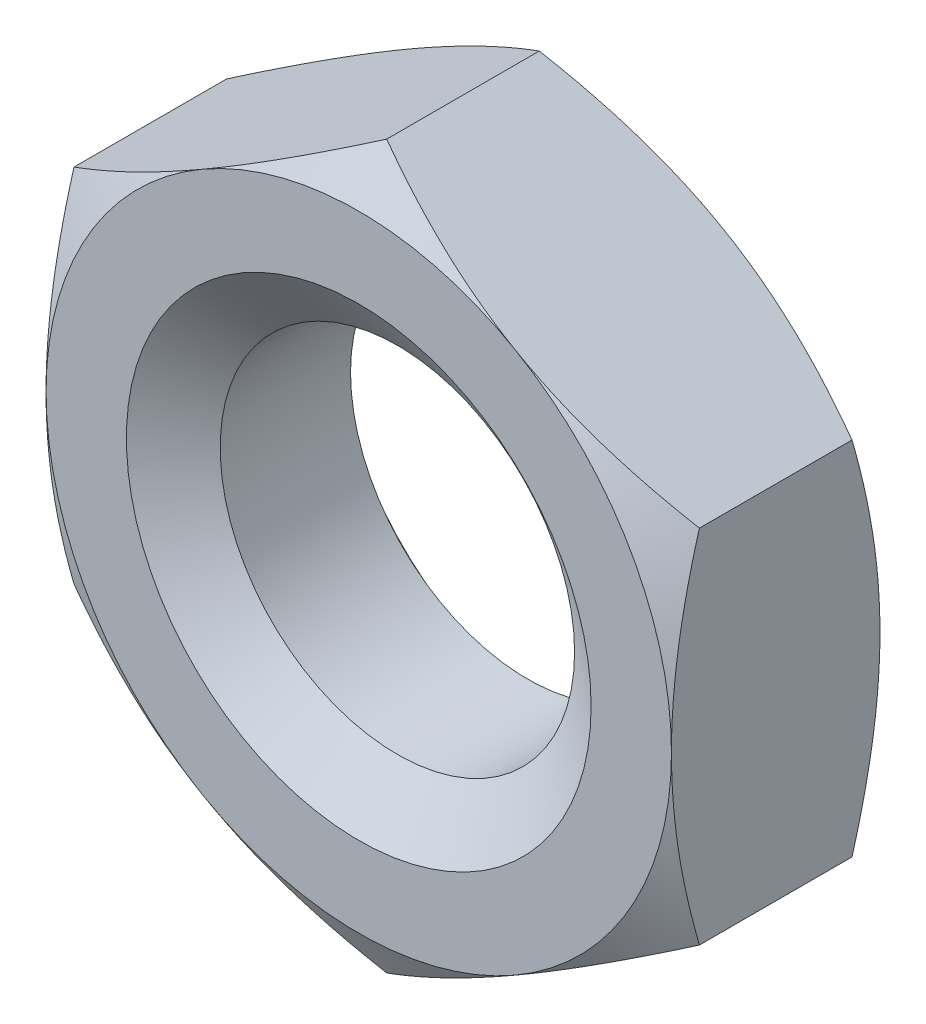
ISO-10303-21;
HEADER;
FILE_DESCRIPTION(('STEP AP214'),'2;1');
FILE_NAME('part.step','',(''),(''),'','','');
FILE_SCHEMA(('AUTOMOTIVE_DESIGN { 1 0 10303 214 1 1 1 1 }'));
ENDSEC;
DATA;
#1=APPLICATION_CONTEXT('core data for automotive mechanical design processes');
#2=APPLICATION_PROTOCOL_DEFINITION('international standard','automotive_design',2000,#1);
#3=PRODUCT_CONTEXT('',#1,'mechanical');
#4=PRODUCT('Part','Part','',(#3));
#5=PRODUCT_RELATED_PRODUCT_CATEGORY('part','',(#4));
#6=PRODUCT_DEFINITION_FORMATION('','',#4);
#7=PRODUCT_DEFINITION_CONTEXT('part definition',#1,'design');
#8=PRODUCT_DEFINITION('design','',#6,#7);
#9=PRODUCT_DEFINITION_SHAPE('','',#8);
#10=(LENGTH_UNIT() NAMED_UNIT(*) SI_UNIT(.MILLI.,.METRE.));
#11=(NAMED_UNIT(*) PLANE_ANGLE_UNIT() SI_UNIT($,.RADIAN.));
#12=(NAMED_UNIT(*) SI_UNIT($,.STERADIAN.) SOLID_ANGLE_UNIT());
#13=UNCERTAINTY_MEASURE_WITH_UNIT(LENGTH_MEASURE(1.E-05),#10,'distance_accuracy_value','');
#14=(GEOMETRIC_REPRESENTATION_CONTEXT(3) GLOBAL_UNCERTAINTY_ASSIGNED_CONTEXT((#13)) GLOBAL_UNIT_ASSIGNED_CONTEXT((#10,
#11,#12)) REPRESENTATION_CONTEXT('',''));
#15=CARTESIAN_POINT('',(0.,0.,0.));
#16=DIRECTION('',(0.,0.,1.));
#17=DIRECTION('',(1.,0.,0.));
#18=AXIS2_PLACEMENT_3D('',#15,#16,#17);
#19=CARTESIAN_POINT('',(0.,0.,-6.00000000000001));
#20=DIRECTION('',(0.,0.,1.));
#21=DIRECTION('',(1.,0.,0.));
#22=AXIS2_PLACEMENT_3D('',#19,#20,#21);
#23=CYLINDRICAL_SURFACE('',#22,5.1);
#24=CARTESIAN_POINT('',(0.,0.,-1.11157946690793));
#25=DIRECTION('',(0.,0.,1.));
#26=DIRECTION('',(1.,0.,0.));
#27=AXIS2_PLACEMENT_3D('',#24,#25,#26);
#28=CIRCLE('',#27,5.1);
#29=CARTESIAN_POINT('',(5.1,0.,-1.11157946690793));
#30=VERTEX_POINT('',#29);
#31=EDGE_CURVE('E192',#30,#30,#28,.F.);
#32=ORIENTED_EDGE('',*,*,#31,.F.);
#33=EDGE_LOOP('',(#32));
#34=FACE_BOUND('',#33,.T.);
#35=CARTESIAN_POINT('',(0.,0.,-4.86302053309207));
#36=DIRECTION('',(0.,0.,-1.));
#37=DIRECTION('',(-1.,0.,0.));
#38=AXIS2_PLACEMENT_3D('',#35,#36,#37);
#39=CIRCLE('',#38,5.1);
#40=CARTESIAN_POINT('',(-5.1,0.,-4.86302053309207));
#41=VERTEX_POINT('',#40);
#42=EDGE_CURVE('E45',#41,#41,#39,.F.);
#43=ORIENTED_EDGE('',*,*,#42,.F.);
#44=EDGE_LOOP('',(#43));
#45=FACE_BOUND('',#44,.T.);
#46=ADVANCED_FACE('F40',(#34,#45),#23,.F.);
#47=CARTESIAN_POINT('',(0.,10.3923048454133,-6.00000000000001));
#48=DIRECTION('',(0.,0.,-1.));
#49=DIRECTION('',(-1.,0.,0.));
#50=AXIS2_PLACEMENT_3D('',#47,#48,#49);
#51=PLANE('',#50);
#52=CARTESIAN_POINT('',(0.,0.,-6.00000000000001));
#53=DIRECTION('',(0.,0.,-1.));
#54=DIRECTION('',(-1.,0.,0.));
#55=AXIS2_PLACEMENT_3D('',#52,#53,#54);
#56=CIRCLE('',#55,9.);
#57=CARTESIAN_POINT('',(-9.00000000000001,0.,-6.00000000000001));
#58=VERTEX_POINT('',#57);
#59=CARTESIAN_POINT('',(-4.5,-7.79422863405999,-6.00000000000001));
#60=VERTEX_POINT('',#59);
#61=EDGE_CURVE('E187',#58,#60,#56,.F.);
#62=ORIENTED_EDGE('',*,*,#61,.F.);
#63=CARTESIAN_POINT('',(-4.5,7.79422863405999,-6.00000000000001));
#64=VERTEX_POINT('',#63);
#65=EDGE_CURVE('E165',#64,#58,#56,.F.);
#66=ORIENTED_EDGE('',*,*,#65,.F.);
#67=CARTESIAN_POINT('',(4.5,7.79422863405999,-6.00000000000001));
#68=VERTEX_POINT('',#67);
#69=EDGE_CURVE('E186',#68,#64,#56,.F.);
#70=ORIENTED_EDGE('',*,*,#69,.F.);
#71=CARTESIAN_POINT('',(0.,0.,-6.00000000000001));
#72=DIRECTION('',(0.,0.,1.));
#73=DIRECTION('',(1.,0.,0.));
#74=AXIS2_PLACEMENT_3D('',#71,#72,#73);
#75=CIRCLE('',#74,9.);
#76=CARTESIAN_POINT('',(9.00000000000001,0.,-6.00000000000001));
#77=VERTEX_POINT('',#76);
#78=EDGE_CURVE('E272',#77,#68,#75,.T.);
#79=ORIENTED_EDGE('',*,*,#78,.F.);
#80=CARTESIAN_POINT('',(4.5,-7.79422863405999,-6.00000000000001));
#81=VERTEX_POINT('',#80);
#82=EDGE_CURVE('E402',#81,#77,#56,.F.);
#83=ORIENTED_EDGE('',*,*,#82,.F.);
#84=EDGE_CURVE('E403',#60,#81,#56,.F.);
#85=ORIENTED_EDGE('',*,*,#84,.F.);
#86=EDGE_LOOP('',(#62,#66,#70,#79,#83,#85));
#87=FACE_BOUND('',#86,.T.);
#88=CARTESIAN_POINT('',(0.,0.,-6.00000000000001));
#89=DIRECTION('',(0.,0.,-1.));
#90=DIRECTION('',(-1.,0.,0.));
#91=AXIS2_PLACEMENT_3D('',#88,#89,#90);
#92=CIRCLE('',#91,6.6875);
#93=CARTESIAN_POINT('',(-6.6875,0.,-6.00000000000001));
#94=VERTEX_POINT('',#93);
#95=EDGE_CURVE('E196',#94,#94,#92,.F.);
#96=ORIENTED_EDGE('',*,*,#95,.T.);
#97=EDGE_LOOP('',(#96));
#98=FACE_BOUND('',#97,.T.);
#99=ADVANCED_FACE('F328',(#87,#98),#51,.T.);
#100=CARTESIAN_POINT('',(0.,10.3923048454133,0.));
#101=DIRECTION('',(0.,0.,-1.));
#102=DIRECTION('',(-1.,0.,0.));
#103=AXIS2_PLACEMENT_3D('',#100,#101,#102);
#104=PLANE('',#103);
#105=CARTESIAN_POINT('',(0.,0.,0.));
#106=DIRECTION('',(0.,0.,-1.));
#107=DIRECTION('',(-1.,0.,0.));
#108=AXIS2_PLACEMENT_3D('',#105,#106,#107);
#109=CIRCLE('',#108,9.);
#110=CARTESIAN_POINT('',(-9.00000000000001,0.,0.));
#111=VERTEX_POINT('',#110);
#112=CARTESIAN_POINT('',(-4.5,7.79422863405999,0.));
#113=VERTEX_POINT('',#112);
#114=EDGE_CURVE('E11',#111,#113,#109,.T.);
#115=ORIENTED_EDGE('',*,*,#114,.F.);
#116=CARTESIAN_POINT('',(-4.5,-7.79422863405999,0.));
#117=VERTEX_POINT('',#116);
#118=EDGE_CURVE('E53',#117,#111,#109,.T.);
#119=ORIENTED_EDGE('',*,*,#118,.F.);
#120=CARTESIAN_POINT('',(4.5,-7.79422863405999,0.));
#121=VERTEX_POINT('',#120);
#122=EDGE_CURVE('E191',#121,#117,#109,.T.);
#123=ORIENTED_EDGE('',*,*,#122,.F.);
#124=CARTESIAN_POINT('',(9.00000000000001,0.,0.));
#125=VERTEX_POINT('',#124);
#126=EDGE_CURVE('E391',#125,#121,#109,.T.);
#127=ORIENTED_EDGE('',*,*,#126,.F.);
#128=CARTESIAN_POINT('',(0.,0.,0.));
#129=DIRECTION('',(0.,0.,1.));
#130=DIRECTION('',(1.,0.,0.));
#131=AXIS2_PLACEMENT_3D('',#128,#129,#130);
#132=CIRCLE('',#131,9.);
#133=CARTESIAN_POINT('',(4.5,7.79422863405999,0.));
#134=VERTEX_POINT('',#133);
#135=EDGE_CURVE('E135',#125,#134,#132,.T.);
#136=ORIENTED_EDGE('',*,*,#135,.T.);
#137=EDGE_CURVE('E51',#113,#134,#109,.T.);
#138=ORIENTED_EDGE('',*,*,#137,.F.);
#139=EDGE_LOOP('',(#115,#119,#123,#127,#136,#138));
#140=FACE_BOUND('',#139,.T.);
#141=CARTESIAN_POINT('',(0.,0.,0.));
#142=DIRECTION('',(0.,0.,1.));
#143=DIRECTION('',(1.,0.,0.));
#144=AXIS2_PLACEMENT_3D('',#141,#142,#143);
#145=CIRCLE('',#144,6.6875);
#146=CARTESIAN_POINT('',(6.6875,0.,0.));
#147=VERTEX_POINT('',#146);
#148=EDGE_CURVE('E195',#147,#147,#145,.T.);
#149=ORIENTED_EDGE('',*,*,#148,.F.);
#150=EDGE_LOOP('',(#149));
#151=FACE_BOUND('',#150,.T.);
#152=ADVANCED_FACE('F277',(#140,#151),#104,.F.);
#153=CARTESIAN_POINT('',(0.,10.3923048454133,-6.00000000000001));
#154=DIRECTION('',(-0.500000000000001,0.866025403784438,0.));
#155=DIRECTION('',(-0.866025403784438,-0.500000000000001,0.));
#156=AXIS2_PLACEMENT_3D('',#153,#154,#155);
#157=PLANE('',#156);
#158=DIRECTION('',(0.,0.,1.));
#159=VECTOR('',#158,1.);
#160=CARTESIAN_POINT('',(-9.00000000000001,5.19615242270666,-6.00000000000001));
#161=LINE('',#160,#159);
#162=CARTESIAN_POINT('',(-9.00000000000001,5.19615242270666,-5.1961524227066));
#163=VERTEX_POINT('',#162);
#164=CARTESIAN_POINT('',(-9.00000000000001,5.19615242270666,-0.803847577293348));
#165=VERTEX_POINT('',#164);
#166=EDGE_CURVE('E179',#163,#165,#161,.T.);
#167=ORIENTED_EDGE('',*,*,#166,.T.);
#168=CARTESIAN_POINT('',(-9.00020000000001,5.1960369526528,-0.803914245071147));
#169=CARTESIAN_POINT('',(-8.8023929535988,5.31024090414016,-0.73798200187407));
#170=CARTESIAN_POINT('',(-8.60381439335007,5.42489028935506,-0.675041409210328));
#171=CARTESIAN_POINT('',(-8.20504463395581,5.65512011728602,-0.555968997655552));
#172=CARTESIAN_POINT('',(-8.00485277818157,5.77070093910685,-0.499840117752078));
#173=CARTESIAN_POINT('',(-7.60248494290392,6.00300811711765,-0.395151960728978));
#174=CARTESIAN_POINT('',(-7.40030540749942,6.11973652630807,-0.346610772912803));
#175=CARTESIAN_POINT('',(-6.99457124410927,6.3539872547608,-0.258148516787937));
#176=CARTESIAN_POINT('',(-6.7910169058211,6.47150940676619,-0.21822568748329));
#177=CARTESIAN_POINT('',(-6.3876940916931,6.70436794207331,-0.148684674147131));
#178=CARTESIAN_POINT('',(-6.18795540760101,6.81968712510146,-0.118837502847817));
#179=CARTESIAN_POINT('',(-5.78758432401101,7.05084147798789,-0.0687933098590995));
#180=CARTESIAN_POINT('',(-5.5869520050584,7.16667660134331,-0.0485954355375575));
#181=CARTESIAN_POINT('',(-5.18533936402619,7.39854776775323,-0.0183543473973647));
#182=CARTESIAN_POINT('',(-4.98435969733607,7.51458343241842,-0.00829960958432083));
#183=CARTESIAN_POINT('',(-4.58221540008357,7.74676155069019,0.00143766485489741));
#184=CARTESIAN_POINT('',(-4.38105077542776,7.86290400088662,0.00112052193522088));
#185=CARTESIAN_POINT('',(-4.00496738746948,8.08003584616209,-0.00916395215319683));
#186=CARTESIAN_POINT('',(-3.8300221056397,8.18104055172,-0.0178767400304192));
#187=CARTESIAN_POINT('',(-3.48054132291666,8.38281337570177,-0.0429773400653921));
#188=CARTESIAN_POINT('',(-3.30600585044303,8.48358147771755,-0.0593656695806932));
#189=CARTESIAN_POINT('',(-2.78307512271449,8.78549567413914,-0.119656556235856));
#190=CARTESIAN_POINT('',(-2.43560548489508,8.9861073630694,-0.174677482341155));
#191=CARTESIAN_POINT('',(-1.736980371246,9.38945876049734,-0.31223047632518));
#192=CARTESIAN_POINT('',(-1.38591405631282,9.59214699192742,-0.395345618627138));
#193=CARTESIAN_POINT('',(-0.689016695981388,9.99450087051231,-0.583982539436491));
#194=CARTESIAN_POINT('',(-0.343176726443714,10.1941716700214,-0.689460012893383));
#195=CARTESIAN_POINT('',(0.000200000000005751,10.3924203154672,-0.803914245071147));
#196=B_SPLINE_CURVE_WITH_KNOTS('',3,(#168,#169,#170,#171,#172,#173,#174,#175,#176,#177,#178,
#179,#180,#181,#182,#183,#184,#185,#186,#187,#188,#189,#190,#191,#192,#193,#194,#195),
.UNSPECIFIED.,.F.,.F.,(4,2,2,2,2,2,2,2,2,2,2,2,2,4),(0.,0.71321924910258,1.42674513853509,
2.14194697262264,2.85700253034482,3.55449749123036,4.25193080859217,4.94857085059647,
5.64518936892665,6.25162976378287,6.85811104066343,8.07193747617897,9.31268391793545,
10.5509947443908),.UNSPECIFIED.);
#197=EDGE_CURVE('E141',#165,#113,#196,.T.);
#198=ORIENTED_EDGE('',*,*,#197,.T.);
#199=CARTESIAN_POINT('',(0.,10.3923048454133,-0.803847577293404));
#200=VERTEX_POINT('',#199);
#201=EDGE_CURVE('E60',#113,#200,#196,.T.);
#202=ORIENTED_EDGE('',*,*,#201,.T.);
#203=DIRECTION('',(0.,0.,1.));
#204=VECTOR('',#203,1.);
#205=CARTESIAN_POINT('',(0.,10.3923048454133,-6.00000000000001));
#206=LINE('',#205,#204);
#207=CARTESIAN_POINT('',(0.,10.3923048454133,-5.1961524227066));
#208=VERTEX_POINT('',#207);
#209=EDGE_CURVE('E159',#208,#200,#206,.T.);
#210=ORIENTED_EDGE('',*,*,#209,.F.);
#211=CARTESIAN_POINT('',(-9.00020000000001,5.1960369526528,-5.19608575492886));
#212=CARTESIAN_POINT('',(-8.8023929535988,5.31024090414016,-5.26201799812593));
#213=CARTESIAN_POINT('',(-8.60381439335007,5.42489028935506,-5.32495859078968));
#214=CARTESIAN_POINT('',(-8.20504463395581,5.65512011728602,-5.44403100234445));
#215=CARTESIAN_POINT('',(-8.00485277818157,5.77070093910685,-5.50015988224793));
#216=CARTESIAN_POINT('',(-7.60248494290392,6.00300811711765,-5.60484803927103));
#217=CARTESIAN_POINT('',(-7.40030540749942,6.11973652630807,-5.6533892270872));
#218=CARTESIAN_POINT('',(-6.99457124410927,6.3539872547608,-5.74185148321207));
#219=CARTESIAN_POINT('',(-6.7910169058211,6.47150940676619,-5.78177431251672));
#220=CARTESIAN_POINT('',(-6.3876940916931,6.70436794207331,-5.85131532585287));
#221=CARTESIAN_POINT('',(-6.18795540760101,6.81968712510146,-5.88116249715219));
#222=CARTESIAN_POINT('',(-5.78758432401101,7.05084147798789,-5.93120669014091));
#223=CARTESIAN_POINT('',(-5.5869520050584,7.16667660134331,-5.95140456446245));
#224=CARTESIAN_POINT('',(-5.18533936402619,7.39854776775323,-5.98164565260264));
#225=CARTESIAN_POINT('',(-4.98435969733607,7.51458343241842,-5.99170039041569));
#226=CARTESIAN_POINT('',(-4.58221540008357,7.74676155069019,-6.0014376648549));
#227=CARTESIAN_POINT('',(-4.38105077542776,7.86290400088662,-6.00112052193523));
#228=CARTESIAN_POINT('',(-4.00496738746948,8.08003584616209,-5.99083604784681));
#229=CARTESIAN_POINT('',(-3.8300221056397,8.18104055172,-5.98212325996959));
#230=CARTESIAN_POINT('',(-3.48054132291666,8.38281337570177,-5.95702265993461));
#231=CARTESIAN_POINT('',(-3.30600585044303,8.48358147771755,-5.94063433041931));
#232=CARTESIAN_POINT('',(-2.78307512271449,8.78549567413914,-5.88034344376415));
#233=CARTESIAN_POINT('',(-2.43560548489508,8.9861073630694,-5.82532251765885));
#234=CARTESIAN_POINT('',(-1.736980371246,9.38945876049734,-5.68776952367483));
#235=CARTESIAN_POINT('',(-1.38591405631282,9.59214699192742,-5.60465438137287));
#236=CARTESIAN_POINT('',(-0.689016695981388,9.99450087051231,-5.41601746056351));
#237=CARTESIAN_POINT('',(-0.343176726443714,10.1941716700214,-5.31053998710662));
#238=CARTESIAN_POINT('',(0.000200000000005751,10.3924203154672,-5.19608575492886));
#239=B_SPLINE_CURVE_WITH_KNOTS('',3,(#211,#212,#213,#214,#215,#216,#217,#218,#219,#220,#221,
#222,#223,#224,#225,#226,#227,#228,#229,#230,#231,#232,#233,#234,#235,#236,#237,#238),
.UNSPECIFIED.,.F.,.F.,(4,2,2,2,2,2,2,2,2,2,2,2,2,4),(0.,0.71321924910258,1.42674513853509,
2.14194697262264,2.85700253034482,3.55449749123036,4.25193080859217,4.94857085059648,
5.64518936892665,6.25162976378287,6.85811104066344,8.07193747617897,9.31268391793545,
10.5509947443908),.UNSPECIFIED.);
#240=EDGE_CURVE('E183',#64,#208,#239,.T.);
#241=ORIENTED_EDGE('',*,*,#240,.F.);
#242=EDGE_CURVE('E288',#163,#64,#239,.T.);
#243=ORIENTED_EDGE('',*,*,#242,.F.);
#244=EDGE_LOOP('',(#167,#198,#202,#210,#241,#243));
#245=FACE_BOUND('',#244,.T.);
#246=ADVANCED_FACE('F42',(#245),#157,.T.);
#247=CARTESIAN_POINT('',(9.00000000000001,5.19615242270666,-6.00000000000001));
#248=DIRECTION('',(0.500000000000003,0.866025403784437,0.));
#249=DIRECTION('',(-0.866025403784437,0.500000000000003,0.));
#250=AXIS2_PLACEMENT_3D('',#247,#248,#249);
#251=PLANE('',#250);
#252=ORIENTED_EDGE('',*,*,#209,.T.);
#253=CARTESIAN_POINT('',(-0.000200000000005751,10.3924203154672,-0.803914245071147));
#254=CARTESIAN_POINT('',(0.197607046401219,10.2782163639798,-0.737982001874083));
#255=CARTESIAN_POINT('',(0.396185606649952,10.1635669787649,-0.675041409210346));
#256=CARTESIAN_POINT('',(0.794955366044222,9.93333715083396,-0.555968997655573));
#257=CARTESIAN_POINT('',(0.995147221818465,9.81775632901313,-0.499840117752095));
#258=CARTESIAN_POINT('',(1.39751505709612,9.58544915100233,-0.395151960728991));
#259=CARTESIAN_POINT('',(1.59969459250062,9.46872074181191,-0.346610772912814));
#260=CARTESIAN_POINT('',(2.00542875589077,9.23447001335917,-0.258148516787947));
#261=CARTESIAN_POINT('',(2.20898309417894,9.11694786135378,-0.2182256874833));
#262=CARTESIAN_POINT('',(2.61230590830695,8.88408932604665,-0.14868467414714));
#263=CARTESIAN_POINT('',(2.81204459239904,8.7687701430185,-0.118837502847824));
#264=CARTESIAN_POINT('',(3.21241567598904,8.53761579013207,-0.068793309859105));
#265=CARTESIAN_POINT('',(3.41304799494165,8.42178066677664,-0.0485954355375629));
#266=CARTESIAN_POINT('',(3.81466063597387,8.18990950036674,-0.0183543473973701));
#267=CARTESIAN_POINT('',(4.015640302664,8.07387383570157,-0.00829960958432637));
#268=CARTESIAN_POINT('',(4.41778459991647,7.84169571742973,0.00143766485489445));
#269=CARTESIAN_POINT('',(4.61894922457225,7.72555326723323,0.00112052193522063));
#270=CARTESIAN_POINT('',(4.99503261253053,7.50842142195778,-0.00916395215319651));
#271=CARTESIAN_POINT('',(5.16997789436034,7.40741671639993,-0.0178767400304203));
#272=CARTESIAN_POINT('',(5.51945867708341,7.20564389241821,-0.0429773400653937));
#273=CARTESIAN_POINT('',(5.69399414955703,7.10487579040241,-0.059365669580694));
#274=CARTESIAN_POINT('',(6.21692487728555,6.8029615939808,-0.119656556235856));
#275=CARTESIAN_POINT('',(6.56439451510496,6.60234990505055,-0.174677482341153));
#276=CARTESIAN_POINT('',(7.26301962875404,6.19899850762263,-0.312230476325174));
#277=CARTESIAN_POINT('',(7.6140859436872,5.99631027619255,-0.395345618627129));
#278=CARTESIAN_POINT('',(8.31098330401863,5.59395639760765,-0.58398253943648));
#279=CARTESIAN_POINT('',(8.6568232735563,5.39428559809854,-0.689460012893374));
#280=CARTESIAN_POINT('',(9.00020000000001,5.1960369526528,-0.803914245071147));
#281=B_SPLINE_CURVE_WITH_KNOTS('',3,(#253,#254,#255,#256,#257,#258,#259,#260,#261,#262,#263,
#264,#265,#266,#267,#268,#269,#270,#271,#272,#273,#274,#275,#276,#277,#278,#279,#280),
.UNSPECIFIED.,.F.,.F.,(4,2,2,2,2,2,2,2,2,2,2,2,2,4),(0.,0.713219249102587,1.42674513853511,
2.14194697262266,2.85700253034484,3.55449749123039,4.25193080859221,4.94857085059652,
5.64518936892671,6.25162976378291,6.85811104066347,8.071937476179,9.31268391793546,
10.5509947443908),.UNSPECIFIED.);
#282=EDGE_CURVE('E151',#200,#134,#281,.T.);
#283=ORIENTED_EDGE('',*,*,#282,.T.);
#284=CARTESIAN_POINT('',(9.00000000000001,5.19615242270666,-0.803847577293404));
#285=VERTEX_POINT('',#284);
#286=EDGE_CURVE('E67',#134,#285,#281,.T.);
#287=ORIENTED_EDGE('',*,*,#286,.T.);
#288=DIRECTION('',(0.,0.,1.));
#289=VECTOR('',#288,1.);
#290=CARTESIAN_POINT('',(9.00000000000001,5.19615242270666,-6.00000000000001));
#291=LINE('',#290,#289);
#292=CARTESIAN_POINT('',(9.00000000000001,5.19615242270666,-5.1961524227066));
#293=VERTEX_POINT('',#292);
#294=EDGE_CURVE('E150',#293,#285,#291,.T.);
#295=ORIENTED_EDGE('',*,*,#294,.F.);
#296=CARTESIAN_POINT('',(-0.000200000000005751,10.3924203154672,-5.19608575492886));
#297=CARTESIAN_POINT('',(0.197607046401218,10.2782163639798,-5.26201799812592));
#298=CARTESIAN_POINT('',(0.396185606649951,10.1635669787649,-5.32495859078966));
#299=CARTESIAN_POINT('',(0.794955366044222,9.93333715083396,-5.44403100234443));
#300=CARTESIAN_POINT('',(0.995147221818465,9.81775632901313,-5.50015988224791));
#301=CARTESIAN_POINT('',(1.39751505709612,9.58544915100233,-5.60484803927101));
#302=CARTESIAN_POINT('',(1.59969459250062,9.4687207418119,-5.65338922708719));
#303=CARTESIAN_POINT('',(2.00542875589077,9.23447001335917,-5.74185148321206));
#304=CARTESIAN_POINT('',(2.20898309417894,9.11694786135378,-5.7817743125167));
#305=CARTESIAN_POINT('',(2.61230590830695,8.88408932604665,-5.85131532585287));
#306=CARTESIAN_POINT('',(2.81204459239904,8.7687701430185,-5.88116249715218));
#307=CARTESIAN_POINT('',(3.21241567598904,8.53761579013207,-5.9312066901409));
#308=CARTESIAN_POINT('',(3.41304799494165,8.42178066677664,-5.95140456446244));
#309=CARTESIAN_POINT('',(3.81466063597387,8.18990950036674,-5.98164565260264));
#310=CARTESIAN_POINT('',(4.015640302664,8.07387383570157,-5.99170039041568));
#311=CARTESIAN_POINT('',(4.41778459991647,7.84169571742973,-6.0014376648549));
#312=CARTESIAN_POINT('',(4.61894922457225,7.72555326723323,-6.00112052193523));
#313=CARTESIAN_POINT('',(4.99503261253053,7.50842142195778,-5.99083604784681));
#314=CARTESIAN_POINT('',(5.16997789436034,7.40741671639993,-5.98212325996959));
#315=CARTESIAN_POINT('',(5.51945867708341,7.20564389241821,-5.95702265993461));
#316=CARTESIAN_POINT('',(5.69399414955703,7.10487579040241,-5.94063433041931));
#317=CARTESIAN_POINT('',(6.21692487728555,6.8029615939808,-5.88034344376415));
#318=CARTESIAN_POINT('',(6.56439451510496,6.60234990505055,-5.82532251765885));
#319=CARTESIAN_POINT('',(7.26301962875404,6.19899850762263,-5.68776952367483));
#320=CARTESIAN_POINT('',(7.6140859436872,5.99631027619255,-5.60465438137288));
#321=CARTESIAN_POINT('',(8.31098330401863,5.59395639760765,-5.41601746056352));
#322=CARTESIAN_POINT('',(8.6568232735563,5.39428559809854,-5.31053998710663));
#323=CARTESIAN_POINT('',(9.00020000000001,5.1960369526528,-5.19608575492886));
#324=B_SPLINE_CURVE_WITH_KNOTS('',3,(#296,#297,#298,#299,#300,#301,#302,#303,#304,#305,#306,
#307,#308,#309,#310,#311,#312,#313,#314,#315,#316,#317,#318,#319,#320,#321,#322,#323),
.UNSPECIFIED.,.F.,.F.,(4,2,2,2,2,2,2,2,2,2,2,2,2,4),(0.,0.713219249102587,1.42674513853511,
2.14194697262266,2.85700253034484,3.55449749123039,4.25193080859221,4.94857085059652,
5.64518936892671,6.25162976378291,6.85811104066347,8.071937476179,9.31268391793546,
10.5509947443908),.UNSPECIFIED.);
#325=EDGE_CURVE('E281',#68,#293,#324,.T.);
#326=ORIENTED_EDGE('',*,*,#325,.F.);
#327=EDGE_CURVE('E287',#208,#68,#324,.T.);
#328=ORIENTED_EDGE('',*,*,#327,.F.);
#329=EDGE_LOOP('',(#252,#283,#287,#295,#326,#328));
#330=FACE_BOUND('',#329,.T.);
#331=ADVANCED_FACE('F148',(#330),#251,.T.);
#332=CARTESIAN_POINT('',(9.00000000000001,5.19615242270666,-6.00000000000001));
#333=DIRECTION('',(-1.,0.,0.));
#334=DIRECTION('',(0.,0.,1.));
#335=AXIS2_PLACEMENT_3D('',#332,#333,#334);
#336=PLANE('',#335);
#337=CARTESIAN_POINT('',(9.00000000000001,-13.7809619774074,-4.30674034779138));
#338=CARTESIAN_POINT('',(9.00000000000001,-13.5833938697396,-4.21123885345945));
#339=CARTESIAN_POINT('',(9.00000000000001,-13.385586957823,-4.11623162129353));
#340=CARTESIAN_POINT('',(9.00000000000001,-12.9894450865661,-3.92731913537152));
#341=CARTESIAN_POINT('',(9.00000000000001,-12.7911101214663,-3.83341389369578));
#342=CARTESIAN_POINT('',(9.00000000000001,-12.1951793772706,-3.55349411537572));
#343=CARTESIAN_POINT('',(9.00000000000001,-11.796721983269,-3.36930666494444));
#344=CARTESIAN_POINT('',(9.00000000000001,-10.9947735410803,-3.0059391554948));
#345=CARTESIAN_POINT('',(9.00000000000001,-10.5912667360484,-2.82679378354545));
#346=CARTESIAN_POINT('',(9.00000000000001,-9.78093737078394,-2.47619472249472));
#347=CARTESIAN_POINT('',(9.00000000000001,-9.3741149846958,-2.30474063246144));
#348=CARTESIAN_POINT('',(9.00000000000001,-8.55145586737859,-1.96953872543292));
#349=CARTESIAN_POINT('',(9.00000000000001,-8.13556978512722,-1.8059113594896));
#350=CARTESIAN_POINT('',(9.00000000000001,-7.29889335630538,-1.49147154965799));
#351=CARTESIAN_POINT('',(9.00000000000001,-6.87810247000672,-1.34066053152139));
#352=CARTESIAN_POINT('',(9.00000000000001,-6.03180598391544,-1.05590655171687));
#353=CARTESIAN_POINT('',(9.00000000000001,-5.60631258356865,-0.92192772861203));
#354=CARTESIAN_POINT('',(9.00000000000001,-4.74929212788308,-0.675187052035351));
#355=CARTESIAN_POINT('',(9.00000000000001,-4.31776702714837,-0.562418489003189));
#356=CARTESIAN_POINT('',(9.00000000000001,-3.44831631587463,-0.363581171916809));
#357=CARTESIAN_POINT('',(9.00000000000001,-3.01038903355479,-0.277519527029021));
#358=CARTESIAN_POINT('',(9.00000000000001,-2.34964451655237,-0.172766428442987));
#359=CARTESIAN_POINT('',(9.00000000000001,-2.12872697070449,-0.141903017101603));
#360=CARTESIAN_POINT('',(9.00000000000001,-1.68585612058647,-0.0888965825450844));
#361=CARTESIAN_POINT('',(9.00000000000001,-1.4639029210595,-0.0667526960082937));
#362=CARTESIAN_POINT('',(9.00000000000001,-1.0206687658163,-0.0317812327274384));
#363=CARTESIAN_POINT('',(9.00000000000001,-0.79939239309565,-0.0188958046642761));
#364=CARTESIAN_POINT('',(9.00000000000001,-0.356492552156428,-0.00250938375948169));
#365=CARTESIAN_POINT('',(9.00000000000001,-0.13486908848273,0.000991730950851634));
#366=CARTESIAN_POINT('',(9.00000000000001,0.308263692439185,-0.00147389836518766));
#367=CARTESIAN_POINT('',(9.00000000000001,0.529773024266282,-0.00743798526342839));
#368=CARTESIAN_POINT('',(9.00000000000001,0.972347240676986,-0.0286857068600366));
#369=CARTESIAN_POINT('',(9.00000000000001,1.19341210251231,-0.04396980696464));
#370=CARTESIAN_POINT('',(9.00000000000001,1.72920526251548,-0.0919895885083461));
#371=CARTESIAN_POINT('',(9.00000000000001,2.04352190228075,-0.129394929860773));
#372=CARTESIAN_POINT('',(9.00000000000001,2.66974660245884,-0.220970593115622));
#373=CARTESIAN_POINT('',(9.00000000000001,2.98165398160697,-0.275145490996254));
#374=CARTESIAN_POINT('',(9.00000000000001,3.60280284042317,-0.398338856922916));
#375=CARTESIAN_POINT('',(9.00000000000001,3.91204150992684,-0.467371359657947));
#376=CARTESIAN_POINT('',(9.00000000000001,4.52733722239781,-0.618173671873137));
#377=CARTESIAN_POINT('',(9.00000000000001,4.83339456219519,-0.699942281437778));
#378=CARTESIAN_POINT('',(9.00000000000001,5.44986573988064,-0.87639800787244));
#379=CARTESIAN_POINT('',(9.00000000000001,5.76020247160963,-0.971352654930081));
#380=CARTESIAN_POINT('',(9.00000000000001,6.37759566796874,-1.17064401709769));
#381=CARTESIAN_POINT('',(9.00000000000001,6.68465423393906,-1.27497426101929));
#382=CARTESIAN_POINT('',(9.00000000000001,7.29425898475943,-1.49086177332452));
#383=CARTESIAN_POINT('',(9.00000000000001,7.59682084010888,-1.60237505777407));
#384=CARTESIAN_POINT('',(9.00000000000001,8.19959709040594,-1.8319468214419));
#385=CARTESIAN_POINT('',(9.00000000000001,8.49981047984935,-1.9500079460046));
#386=CARTESIAN_POINT('',(9.00000000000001,8.79893322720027,-2.07069526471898));
#387=B_SPLINE_CURVE_WITH_KNOTS('',3,(#337,#338,#339,#340,#341,#342,#343,#344,#345,#346,#347,
#348,#349,#350,#351,#352,#353,#354,#355,#356,#357,#358,#359,#360,#361,#362,#363,#364,#365,#366,
#367,#368,#369,#370,#371,#372,#373,#374,#375,#376,#377,#378,#379,#380,#381,#382,#383,#384,#385,
#386),.UNSPECIFIED.,.F.,.F.,(4,2,2,2,2,2,2,2,2,2,2,2,2,2,2,2,2,2,2,2,2,2,2,2,4),(0.,
0.658317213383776,1.31664163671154,2.63350462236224,3.95790348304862,5.28223322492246,
6.62282162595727,7.96355896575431,9.3013895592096,10.6387962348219,11.9765586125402,
12.6456025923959,13.3145803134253,13.9793407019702,14.6440924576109,15.3086576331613,
15.9732559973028,16.9223307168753,17.8716646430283,18.82189928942,19.772044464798,
20.7454797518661,21.7182482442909,22.6855413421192,23.6532281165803),.UNSPECIFIED.);
#388=CARTESIAN_POINT('',(9.00000000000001,-5.19615242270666,-0.803847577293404));
#389=VERTEX_POINT('',#388);
#390=EDGE_CURVE('E143',#389,#125,#387,.T.);
#391=ORIENTED_EDGE('',*,*,#390,.F.);
#392=DIRECTION('',(0.,0.,1.));
#393=VECTOR('',#392,1.);
#394=CARTESIAN_POINT('',(9.00000000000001,-5.19615242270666,-6.00000000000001));
#395=LINE('',#394,#393);
#396=CARTESIAN_POINT('',(9.00000000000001,-5.19615242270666,-5.1961524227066));
#397=VERTEX_POINT('',#396);
#398=EDGE_CURVE('E160',#397,#389,#395,.T.);
#399=ORIENTED_EDGE('',*,*,#398,.F.);
#400=CARTESIAN_POINT('',(9.00000000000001,-13.7809619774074,-1.69325965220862));
#401=CARTESIAN_POINT('',(9.00000000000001,-13.5833938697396,-1.78876114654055));
#402=CARTESIAN_POINT('',(9.00000000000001,-13.385586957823,-1.88376837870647));
#403=CARTESIAN_POINT('',(9.00000000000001,-12.9894450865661,-2.07268086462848));
#404=CARTESIAN_POINT('',(9.00000000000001,-12.7911101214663,-2.16658610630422));
#405=CARTESIAN_POINT('',(9.00000000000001,-12.1951793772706,-2.44650588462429));
#406=CARTESIAN_POINT('',(9.00000000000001,-11.796721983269,-2.63069333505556));
#407=CARTESIAN_POINT('',(9.00000000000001,-10.9947735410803,-2.9940608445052));
#408=CARTESIAN_POINT('',(9.00000000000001,-10.5912667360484,-3.17320621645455));
#409=CARTESIAN_POINT('',(9.00000000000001,-9.78093737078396,-3.52380527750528));
#410=CARTESIAN_POINT('',(9.00000000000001,-9.37411498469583,-3.69525936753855));
#411=CARTESIAN_POINT('',(9.00000000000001,-8.55145586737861,-4.03046127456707));
#412=CARTESIAN_POINT('',(9.00000000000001,-8.13556978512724,-4.19408864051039));
#413=CARTESIAN_POINT('',(9.00000000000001,-7.29889335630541,-4.508528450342));
#414=CARTESIAN_POINT('',(9.00000000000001,-6.87810247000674,-4.6593394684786));
#415=CARTESIAN_POINT('',(9.00000000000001,-6.03180598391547,-4.94409344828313));
#416=CARTESIAN_POINT('',(9.00000000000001,-5.60631258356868,-5.07807227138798));
#417=CARTESIAN_POINT('',(9.00000000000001,-4.74929212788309,-5.32481294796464));
#418=CARTESIAN_POINT('',(9.00000000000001,-4.31776702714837,-5.43758151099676));
#419=CARTESIAN_POINT('',(9.00000000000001,-3.44831631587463,-5.63641882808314));
#420=CARTESIAN_POINT('',(9.00000000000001,-3.0103890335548,-5.72248047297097));
#421=CARTESIAN_POINT('',(9.00000000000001,-2.34964451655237,-5.82723357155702));
#422=CARTESIAN_POINT('',(9.00000000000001,-2.1287269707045,-5.8580969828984));
#423=CARTESIAN_POINT('',(9.00000000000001,-1.68585612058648,-5.91110341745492));
#424=CARTESIAN_POINT('',(9.00000000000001,-1.4639029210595,-5.93324730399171));
#425=CARTESIAN_POINT('',(9.00000000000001,-1.0206687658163,-5.96821876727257));
#426=CARTESIAN_POINT('',(9.00000000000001,-0.799392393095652,-5.98110419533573));
#427=CARTESIAN_POINT('',(9.00000000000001,-0.35649255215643,-5.99749061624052));
#428=CARTESIAN_POINT('',(9.00000000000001,-0.134869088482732,-6.00099173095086));
#429=CARTESIAN_POINT('',(9.00000000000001,0.308263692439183,-5.99852610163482));
#430=CARTESIAN_POINT('',(9.00000000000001,0.52977302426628,-5.99256201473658));
#431=CARTESIAN_POINT('',(9.00000000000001,0.972347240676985,-5.97131429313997));
#432=CARTESIAN_POINT('',(9.00000000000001,1.19341210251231,-5.95603019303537));
#433=CARTESIAN_POINT('',(9.00000000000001,1.72920526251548,-5.90801041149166));
#434=CARTESIAN_POINT('',(9.00000000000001,2.04352190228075,-5.87060507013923));
#435=CARTESIAN_POINT('',(9.00000000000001,2.66974660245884,-5.77902940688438));
#436=CARTESIAN_POINT('',(9.00000000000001,2.98165398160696,-5.72485450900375));
#437=CARTESIAN_POINT('',(9.00000000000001,3.60280284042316,-5.60166114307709));
#438=CARTESIAN_POINT('',(9.00000000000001,3.91204150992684,-5.53262864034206));
#439=CARTESIAN_POINT('',(9.00000000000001,4.5273372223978,-5.38182632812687));
#440=CARTESIAN_POINT('',(9.00000000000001,4.83339456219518,-5.30005771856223));
#441=CARTESIAN_POINT('',(9.00000000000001,5.44986573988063,-5.12360199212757));
#442=CARTESIAN_POINT('',(9.00000000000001,5.76020247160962,-5.02864734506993));
#443=CARTESIAN_POINT('',(9.00000000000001,6.37759566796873,-4.82935598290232));
#444=CARTESIAN_POINT('',(9.00000000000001,6.68465423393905,-4.72502573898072));
#445=CARTESIAN_POINT('',(9.00000000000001,7.29425898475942,-4.50913822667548));
#446=CARTESIAN_POINT('',(9.00000000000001,7.59682084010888,-4.39762494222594));
#447=CARTESIAN_POINT('',(9.00000000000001,8.19959709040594,-4.16805317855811));
#448=CARTESIAN_POINT('',(9.00000000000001,8.49981047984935,-4.0499920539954));
#449=CARTESIAN_POINT('',(9.00000000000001,8.79893322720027,-3.92930473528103));
#450=B_SPLINE_CURVE_WITH_KNOTS('',3,(#400,#401,#402,#403,#404,#405,#406,#407,#408,#409,#410,
#411,#412,#413,#414,#415,#416,#417,#418,#419,#420,#421,#422,#423,#424,#425,#426,#427,#428,#429,
#430,#431,#432,#433,#434,#435,#436,#437,#438,#439,#440,#441,#442,#443,#444,#445,#446,#447,#448,
#449),.UNSPECIFIED.,.F.,.F.,(4,2,2,2,2,2,2,2,2,2,2,2,2,2,2,2,2,2,2,2,2,2,2,2,4),(0.,
0.658317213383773,1.31664163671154,2.63350462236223,3.9579034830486,5.28223322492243,
6.62282162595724,7.96355896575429,9.30138955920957,10.6387962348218,11.9765586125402,
12.6456025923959,13.3145803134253,13.9793407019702,14.6440924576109,15.3086576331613,
15.9732559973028,16.9223307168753,17.8716646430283,18.82189928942,19.7720444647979,
20.745479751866,21.7182482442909,22.6855413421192,23.6532281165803),.UNSPECIFIED.);
#451=EDGE_CURVE('E294',#397,#77,#450,.T.);
#452=ORIENTED_EDGE('',*,*,#451,.T.);
#453=EDGE_CURVE('E157',#77,#293,#450,.T.);
#454=ORIENTED_EDGE('',*,*,#453,.T.);
#455=ORIENTED_EDGE('',*,*,#294,.T.);
#456=EDGE_CURVE('E132',#125,#285,#387,.T.);
#457=ORIENTED_EDGE('',*,*,#456,.F.);
#458=EDGE_LOOP('',(#391,#399,#452,#454,#455,#457));
#459=FACE_BOUND('',#458,.T.);
#460=ADVANCED_FACE('F155',(#459),#336,.F.);
#461=CARTESIAN_POINT('',(0.,-10.3923048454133,-6.00000000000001));
#462=DIRECTION('',(0.500000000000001,-0.866025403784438,0.));
#463=DIRECTION('',(0.866025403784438,0.500000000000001,0.));
#464=AXIS2_PLACEMENT_3D('',#461,#462,#463);
#465=PLANE('',#464);
#466=ORIENTED_EDGE('',*,*,#398,.T.);
#467=CARTESIAN_POINT('',(9.00020000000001,-5.1960369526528,-0.803914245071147));
#468=CARTESIAN_POINT('',(8.8023929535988,-5.31024090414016,-0.737982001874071));
#469=CARTESIAN_POINT('',(8.60381439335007,-5.42489028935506,-0.67504140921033));
#470=CARTESIAN_POINT('',(8.20504463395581,-5.65512011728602,-0.555968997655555));
#471=CARTESIAN_POINT('',(8.00485277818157,-5.77070093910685,-0.49984011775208));
#472=CARTESIAN_POINT('',(7.60248494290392,-6.00300811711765,-0.39515196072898));
#473=CARTESIAN_POINT('',(7.40030540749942,-6.11973652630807,-0.346610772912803));
#474=CARTESIAN_POINT('',(6.99457124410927,-6.3539872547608,-0.258148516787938));
#475=CARTESIAN_POINT('',(6.7910169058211,-6.47150940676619,-0.218225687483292));
#476=CARTESIAN_POINT('',(6.3876940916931,-6.70436794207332,-0.148684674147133));
#477=CARTESIAN_POINT('',(6.18795540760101,-6.81968712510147,-0.118837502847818));
#478=CARTESIAN_POINT('',(5.78758432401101,-7.05084147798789,-0.0687933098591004));
#479=CARTESIAN_POINT('',(5.5869520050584,-7.16667660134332,-0.0485954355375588));
#480=CARTESIAN_POINT('',(5.18533936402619,-7.39854776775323,-0.0183543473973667));
#481=CARTESIAN_POINT('',(4.98435969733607,-7.51458343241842,-0.00829960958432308));
#482=CARTESIAN_POINT('',(4.58221540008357,-7.74676155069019,0.00143766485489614));
#483=CARTESIAN_POINT('',(4.38105077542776,-7.86290400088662,0.00112052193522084));
#484=CARTESIAN_POINT('',(4.00496738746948,-8.08003584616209,-0.00916395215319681));
#485=CARTESIAN_POINT('',(3.8300221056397,-8.18104055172,-0.0178767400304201));
#486=CARTESIAN_POINT('',(3.48054132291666,-8.38281337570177,-0.0429773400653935));
#487=CARTESIAN_POINT('',(3.30600585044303,-8.48358147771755,-0.0593656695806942));
#488=CARTESIAN_POINT('',(2.78307512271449,-8.78549567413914,-0.119656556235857));
#489=CARTESIAN_POINT('',(2.43560548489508,-8.9861073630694,-0.174677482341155));
#490=CARTESIAN_POINT('',(1.736980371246,-9.38945876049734,-0.31223047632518));
#491=CARTESIAN_POINT('',(1.38591405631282,-9.59214699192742,-0.395345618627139));
#492=CARTESIAN_POINT('',(0.689016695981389,-9.99450087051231,-0.583982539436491));
#493=CARTESIAN_POINT('',(0.343176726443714,-10.1941716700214,-0.689460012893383));
#494=CARTESIAN_POINT('',(-0.000200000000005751,-10.3924203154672,-0.803914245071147));
#495=B_SPLINE_CURVE_WITH_KNOTS('',3,(#467,#468,#469,#470,#471,#472,#473,#474,#475,#476,#477,
#478,#479,#480,#481,#482,#483,#484,#485,#486,#487,#488,#489,#490,#491,#492,#493,#494),
.UNSPECIFIED.,.F.,.F.,(4,2,2,2,2,2,2,2,2,2,2,2,2,4),(0.,0.71321924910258,1.4267451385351,
2.14194697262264,2.85700253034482,3.55449749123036,4.25193080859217,4.94857085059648,
5.64518936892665,6.25162976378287,6.85811104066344,8.07193747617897,9.31268391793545,
10.5509947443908),.UNSPECIFIED.);
#496=EDGE_CURVE('E381',#389,#121,#495,.T.);
#497=ORIENTED_EDGE('',*,*,#496,.T.);
#498=CARTESIAN_POINT('',(0.,-10.3923048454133,-0.803847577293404));
#499=VERTEX_POINT('',#498);
#500=EDGE_CURVE('E252',#121,#499,#495,.T.);
#501=ORIENTED_EDGE('',*,*,#500,.T.);
#502=DIRECTION('',(0.,0.,1.));
#503=VECTOR('',#502,1.);
#504=CARTESIAN_POINT('',(0.,-10.3923048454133,-6.00000000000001));
#505=LINE('',#504,#503);
#506=CARTESIAN_POINT('',(0.,-10.3923048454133,-5.1961524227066));
#507=VERTEX_POINT('',#506);
#508=EDGE_CURVE('E169',#507,#499,#505,.T.);
#509=ORIENTED_EDGE('',*,*,#508,.F.);
#510=CARTESIAN_POINT('',(9.00020000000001,-5.1960369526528,-5.19608575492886));
#511=CARTESIAN_POINT('',(8.8023929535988,-5.31024090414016,-5.26201799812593));
#512=CARTESIAN_POINT('',(8.60381439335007,-5.42489028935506,-5.32495859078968));
#513=CARTESIAN_POINT('',(8.20504463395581,-5.65512011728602,-5.44403100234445));
#514=CARTESIAN_POINT('',(8.00485277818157,-5.77070093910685,-5.50015988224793));
#515=CARTESIAN_POINT('',(7.60248494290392,-6.00300811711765,-5.60484803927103));
#516=CARTESIAN_POINT('',(7.40030540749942,-6.11973652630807,-5.6533892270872));
#517=CARTESIAN_POINT('',(6.99457124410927,-6.3539872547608,-5.74185148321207));
#518=CARTESIAN_POINT('',(6.7910169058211,-6.47150940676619,-5.78177431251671));
#519=CARTESIAN_POINT('',(6.3876940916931,-6.70436794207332,-5.85131532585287));
#520=CARTESIAN_POINT('',(6.18795540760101,-6.81968712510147,-5.88116249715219));
#521=CARTESIAN_POINT('',(5.78758432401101,-7.05084147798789,-5.9312066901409));
#522=CARTESIAN_POINT('',(5.5869520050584,-7.16667660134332,-5.95140456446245));
#523=CARTESIAN_POINT('',(5.18533936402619,-7.39854776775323,-5.98164565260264));
#524=CARTESIAN_POINT('',(4.98435969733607,-7.51458343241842,-5.99170039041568));
#525=CARTESIAN_POINT('',(4.58221540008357,-7.74676155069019,-6.0014376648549));
#526=CARTESIAN_POINT('',(4.38105077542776,-7.86290400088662,-6.00112052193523));
#527=CARTESIAN_POINT('',(4.00496738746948,-8.08003584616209,-5.99083604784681));
#528=CARTESIAN_POINT('',(3.8300221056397,-8.18104055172,-5.98212325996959));
#529=CARTESIAN_POINT('',(3.48054132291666,-8.38281337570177,-5.95702265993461));
#530=CARTESIAN_POINT('',(3.30600585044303,-8.48358147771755,-5.94063433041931));
#531=CARTESIAN_POINT('',(2.78307512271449,-8.78549567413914,-5.88034344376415));
#532=CARTESIAN_POINT('',(2.43560548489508,-8.9861073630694,-5.82532251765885));
#533=CARTESIAN_POINT('',(1.736980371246,-9.38945876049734,-5.68776952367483));
#534=CARTESIAN_POINT('',(1.38591405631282,-9.59214699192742,-5.60465438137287));
#535=CARTESIAN_POINT('',(0.689016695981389,-9.99450087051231,-5.41601746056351));
#536=CARTESIAN_POINT('',(0.343176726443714,-10.1941716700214,-5.31053998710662));
#537=CARTESIAN_POINT('',(-0.000200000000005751,-10.3924203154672,-5.19608575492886));
#538=B_SPLINE_CURVE_WITH_KNOTS('',3,(#510,#511,#512,#513,#514,#515,#516,#517,#518,#519,#520,
#521,#522,#523,#524,#525,#526,#527,#528,#529,#530,#531,#532,#533,#534,#535,#536,#537),
.UNSPECIFIED.,.F.,.F.,(4,2,2,2,2,2,2,2,2,2,2,2,2,4),(0.,0.71321924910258,1.4267451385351,
2.14194697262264,2.85700253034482,3.55449749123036,4.25193080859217,4.94857085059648,
5.64518936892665,6.25162976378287,6.85811104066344,8.07193747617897,9.31268391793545,
10.5509947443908),.UNSPECIFIED.);
#539=EDGE_CURVE('E301',#81,#507,#538,.T.);
#540=ORIENTED_EDGE('',*,*,#539,.F.);
#541=EDGE_CURVE('E300',#397,#81,#538,.T.);
#542=ORIENTED_EDGE('',*,*,#541,.F.);
#543=EDGE_LOOP('',(#466,#497,#501,#509,#540,#542));
#544=FACE_BOUND('',#543,.T.);
#545=ADVANCED_FACE('F312',(#544),#465,.T.);
#546=CARTESIAN_POINT('',(-9.00000000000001,-5.19615242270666,-6.00000000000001));
#547=DIRECTION('',(-0.500000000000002,-0.866025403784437,0.));
#548=DIRECTION('',(0.866025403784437,-0.500000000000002,0.));
#549=AXIS2_PLACEMENT_3D('',#546,#547,#548);
#550=PLANE('',#549);
#551=ORIENTED_EDGE('',*,*,#508,.T.);
#552=CARTESIAN_POINT('',(0.000200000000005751,-10.3924203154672,-0.803914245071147));
#553=CARTESIAN_POINT('',(-0.197607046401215,-10.2782163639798,-0.737982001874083));
#554=CARTESIAN_POINT('',(-0.396185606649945,-10.1635669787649,-0.675041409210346));
#555=CARTESIAN_POINT('',(-0.794955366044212,-9.93333715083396,-0.555968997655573));
#556=CARTESIAN_POINT('',(-0.995147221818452,-9.81775632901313,-0.499840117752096));
#557=CARTESIAN_POINT('',(-1.3975150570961,-9.58544915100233,-0.395151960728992));
#558=CARTESIAN_POINT('',(-1.5996945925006,-9.46872074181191,-0.346610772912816));
#559=CARTESIAN_POINT('',(-2.00542875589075,-9.23447001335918,-0.258148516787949));
#560=CARTESIAN_POINT('',(-2.20898309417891,-9.11694786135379,-0.218225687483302));
#561=CARTESIAN_POINT('',(-2.61230590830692,-8.88408932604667,-0.148684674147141));
#562=CARTESIAN_POINT('',(-2.81204459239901,-8.76877014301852,-0.118837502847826));
#563=CARTESIAN_POINT('',(-3.212415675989,-8.53761579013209,-0.068793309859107));
#564=CARTESIAN_POINT('',(-3.41304799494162,-8.42178066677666,-0.0485954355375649));
#565=CARTESIAN_POINT('',(-3.81466063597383,-8.18990950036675,-0.0183543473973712));
#566=CARTESIAN_POINT('',(-4.01564030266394,-8.07387383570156,-0.00829960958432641));
#567=CARTESIAN_POINT('',(-4.41778459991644,-7.84169571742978,0.00143766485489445));
#568=CARTESIAN_POINT('',(-4.61894922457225,-7.72555326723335,0.00112052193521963));
#569=CARTESIAN_POINT('',(-4.99503261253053,-7.50842142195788,-0.00916395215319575));
#570=CARTESIAN_POINT('',(-5.16997789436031,-7.40741671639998,-0.0178767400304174));
#571=CARTESIAN_POINT('',(-5.51945867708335,-7.2056438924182,-0.0429773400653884));
#572=CARTESIAN_POINT('',(-5.69399414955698,-7.10487579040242,-0.0593656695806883));
#573=CARTESIAN_POINT('',(-6.21692487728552,-6.80296159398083,-0.119656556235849));
#574=CARTESIAN_POINT('',(-6.56439451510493,-6.60234990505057,-0.174677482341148));
#575=CARTESIAN_POINT('',(-7.26301962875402,-6.19899850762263,-0.312230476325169));
#576=CARTESIAN_POINT('',(-7.61408594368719,-5.99631027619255,-0.395345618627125));
#577=CARTESIAN_POINT('',(-8.31098330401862,-5.59395639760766,-0.583982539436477));
#578=CARTESIAN_POINT('',(-8.6568232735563,-5.39428559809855,-0.689460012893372));
#579=CARTESIAN_POINT('',(-9.00020000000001,-5.1960369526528,-0.803914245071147));
#580=B_SPLINE_CURVE_WITH_KNOTS('',3,(#552,#553,#554,#555,#556,#557,#558,#559,#560,#561,#562,
#563,#564,#565,#566,#567,#568,#569,#570,#571,#572,#573,#574,#575,#576,#577,#578,#579),
.UNSPECIFIED.,.F.,.F.,(4,2,2,2,2,2,2,2,2,2,2,2,2,4),(0.,0.71321924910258,1.42674513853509,
2.14194697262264,2.85700253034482,3.55449749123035,4.25193080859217,4.94857085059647,
5.64518936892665,6.25162976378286,6.85811104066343,8.07193747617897,9.31268391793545,
10.5509947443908),.UNSPECIFIED.);
#581=EDGE_CURVE('E377',#499,#117,#580,.T.);
#582=ORIENTED_EDGE('',*,*,#581,.T.);
#583=CARTESIAN_POINT('',(-9.00000000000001,-5.19615242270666,-0.803847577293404));
#584=VERTEX_POINT('',#583);
#585=EDGE_CURVE('E226',#117,#584,#580,.T.);
#586=ORIENTED_EDGE('',*,*,#585,.T.);
#587=DIRECTION('',(0.,0.,1.));
#588=VECTOR('',#587,1.);
#589=CARTESIAN_POINT('',(-9.00000000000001,-5.19615242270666,-6.00000000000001));
#590=LINE('',#589,#588);
#591=CARTESIAN_POINT('',(-9.00000000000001,-5.19615242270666,-5.1961524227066));
#592=VERTEX_POINT('',#591);
#593=EDGE_CURVE('E176',#592,#584,#590,.T.);
#594=ORIENTED_EDGE('',*,*,#593,.F.);
#595=CARTESIAN_POINT('',(0.000200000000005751,-10.3924203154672,-5.19608575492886));
#596=CARTESIAN_POINT('',(-0.197607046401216,-10.2782163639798,-5.26201799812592));
#597=CARTESIAN_POINT('',(-0.396185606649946,-10.1635669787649,-5.32495859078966));
#598=CARTESIAN_POINT('',(-0.794955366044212,-9.93333715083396,-5.44403100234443));
#599=CARTESIAN_POINT('',(-0.995147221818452,-9.81775632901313,-5.50015988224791));
#600=CARTESIAN_POINT('',(-1.3975150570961,-9.58544915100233,-5.60484803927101));
#601=CARTESIAN_POINT('',(-1.5996945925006,-9.46872074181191,-5.65338922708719));
#602=CARTESIAN_POINT('',(-2.00542875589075,-9.23447001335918,-5.74185148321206));
#603=CARTESIAN_POINT('',(-2.20898309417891,-9.11694786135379,-5.7817743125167));
#604=CARTESIAN_POINT('',(-2.61230590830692,-8.88408932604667,-5.85131532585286));
#605=CARTESIAN_POINT('',(-2.81204459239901,-8.76877014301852,-5.88116249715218));
#606=CARTESIAN_POINT('',(-3.212415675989,-8.53761579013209,-5.9312066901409));
#607=CARTESIAN_POINT('',(-3.41304799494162,-8.42178066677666,-5.95140456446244));
#608=CARTESIAN_POINT('',(-3.81466063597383,-8.18990950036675,-5.98164565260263));
#609=CARTESIAN_POINT('',(-4.01564030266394,-8.07387383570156,-5.99170039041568));
#610=CARTESIAN_POINT('',(-4.41778459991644,-7.84169571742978,-6.0014376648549));
#611=CARTESIAN_POINT('',(-4.61894922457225,-7.72555326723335,-6.00112052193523));
#612=CARTESIAN_POINT('',(-4.99503261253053,-7.50842142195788,-5.99083604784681));
#613=CARTESIAN_POINT('',(-5.16997789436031,-7.40741671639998,-5.98212325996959));
#614=CARTESIAN_POINT('',(-5.51945867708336,-7.2056438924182,-5.95702265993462));
#615=CARTESIAN_POINT('',(-5.69399414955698,-7.10487579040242,-5.94063433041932));
#616=CARTESIAN_POINT('',(-6.21692487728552,-6.80296159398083,-5.88034344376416));
#617=CARTESIAN_POINT('',(-6.56439451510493,-6.60234990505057,-5.82532251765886));
#618=CARTESIAN_POINT('',(-7.26301962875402,-6.19899850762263,-5.68776952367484));
#619=CARTESIAN_POINT('',(-7.61408594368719,-5.99631027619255,-5.60465438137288));
#620=CARTESIAN_POINT('',(-8.31098330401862,-5.59395639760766,-5.41601746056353));
#621=CARTESIAN_POINT('',(-8.6568232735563,-5.39428559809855,-5.31053998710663));
#622=CARTESIAN_POINT('',(-9.00020000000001,-5.1960369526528,-5.19608575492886));
#623=B_SPLINE_CURVE_WITH_KNOTS('',3,(#595,#596,#597,#598,#599,#600,#601,#602,#603,#604,#605,
#606,#607,#608,#609,#610,#611,#612,#613,#614,#615,#616,#617,#618,#619,#620,#621,#622),
.UNSPECIFIED.,.F.,.F.,(4,2,2,2,2,2,2,2,2,2,2,2,2,4),(0.,0.71321924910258,1.42674513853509,
2.14194697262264,2.85700253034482,3.55449749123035,4.25193080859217,4.94857085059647,
5.64518936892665,6.25162976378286,6.85811104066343,8.07193747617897,9.31268391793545,
10.5509947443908),.UNSPECIFIED.);
#624=EDGE_CURVE('E308',#60,#592,#623,.T.);
#625=ORIENTED_EDGE('',*,*,#624,.F.);
#626=EDGE_CURVE('E307',#507,#60,#623,.T.);
#627=ORIENTED_EDGE('',*,*,#626,.F.);
#628=EDGE_LOOP('',(#551,#582,#586,#594,#625,#627));
#629=FACE_BOUND('',#628,.T.);
#630=ADVANCED_FACE('F315',(#629),#550,.T.);
#631=CARTESIAN_POINT('',(-9.00000000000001,5.19615242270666,-6.00000000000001));
#632=DIRECTION('',(-1.,0.,0.));
#633=DIRECTION('',(0.,0.,1.));
#634=AXIS2_PLACEMENT_3D('',#631,#632,#633);
#635=PLANE('',#634);
#636=ORIENTED_EDGE('',*,*,#593,.T.);
#637=CARTESIAN_POINT('',(-9.00000000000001,-13.7809619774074,-4.30674034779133));
#638=CARTESIAN_POINT('',(-9.00000000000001,-13.5833938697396,-4.21123885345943));
#639=CARTESIAN_POINT('',(-9.00000000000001,-13.3855869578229,-4.11623162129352));
#640=CARTESIAN_POINT('',(-9.00000000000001,-12.989445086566,-3.92731913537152));
#641=CARTESIAN_POINT('',(-9.00000000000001,-12.7911101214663,-3.83341389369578));
#642=CARTESIAN_POINT('',(-9.00000000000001,-12.1951793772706,-3.55349411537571));
#643=CARTESIAN_POINT('',(-9.00000000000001,-11.796721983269,-3.36930666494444));
#644=CARTESIAN_POINT('',(-9.00000000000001,-10.9947735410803,-3.0059391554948));
#645=CARTESIAN_POINT('',(-9.00000000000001,-10.5912667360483,-2.82679378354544));
#646=CARTESIAN_POINT('',(-9.00000000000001,-9.78093737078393,-2.47619472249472));
#647=CARTESIAN_POINT('',(-9.00000000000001,-9.3741149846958,-2.30474063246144));
#648=CARTESIAN_POINT('',(-9.00000000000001,-8.55145586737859,-1.96953872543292));
#649=CARTESIAN_POINT('',(-9.00000000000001,-8.13556978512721,-1.8059113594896));
#650=CARTESIAN_POINT('',(-9.00000000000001,-7.29889335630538,-1.49147154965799));
#651=CARTESIAN_POINT('',(-9.00000000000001,-6.87810247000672,-1.34066053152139));
#652=CARTESIAN_POINT('',(-9.00000000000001,-6.03180598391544,-1.05590655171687));
#653=CARTESIAN_POINT('',(-9.00000000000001,-5.60631258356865,-0.92192772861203));
#654=CARTESIAN_POINT('',(-9.00000000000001,-4.74929212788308,-0.675187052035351));
#655=CARTESIAN_POINT('',(-9.00000000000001,-4.31776702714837,-0.562418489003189));
#656=CARTESIAN_POINT('',(-9.00000000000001,-3.44831631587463,-0.363581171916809));
#657=CARTESIAN_POINT('',(-9.00000000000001,-3.01038903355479,-0.277519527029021));
#658=CARTESIAN_POINT('',(-9.00000000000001,-2.34964451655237,-0.172766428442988));
#659=CARTESIAN_POINT('',(-9.00000000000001,-2.12872697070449,-0.141903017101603));
#660=CARTESIAN_POINT('',(-9.00000000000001,-1.68585612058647,-0.0888965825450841));
#661=CARTESIAN_POINT('',(-9.00000000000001,-1.4639029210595,-0.0667526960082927));
#662=CARTESIAN_POINT('',(-9.00000000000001,-1.0206687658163,-0.0317812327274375));
#663=CARTESIAN_POINT('',(-9.00000000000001,-0.799392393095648,-0.0188958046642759));
#664=CARTESIAN_POINT('',(-9.00000000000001,-0.356492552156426,-0.00250938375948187));
#665=CARTESIAN_POINT('',(-9.00000000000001,-0.134869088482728,0.000991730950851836));
#666=CARTESIAN_POINT('',(-9.00000000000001,0.308263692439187,-0.00147389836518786));
#667=CARTESIAN_POINT('',(-9.00000000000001,0.529773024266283,-0.00743798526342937));
#668=CARTESIAN_POINT('',(-9.00000000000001,0.972347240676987,-0.0286857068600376));
#669=CARTESIAN_POINT('',(-9.00000000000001,1.19341210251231,-0.0439698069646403));
#670=CARTESIAN_POINT('',(-9.00000000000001,1.72920526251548,-0.0919895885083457));
#671=CARTESIAN_POINT('',(-9.00000000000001,2.04352190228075,-0.129394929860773));
#672=CARTESIAN_POINT('',(-9.00000000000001,2.66974660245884,-0.220970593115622));
#673=CARTESIAN_POINT('',(-9.00000000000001,2.98165398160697,-0.275145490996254));
#674=CARTESIAN_POINT('',(-9.00000000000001,3.60280284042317,-0.398338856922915));
#675=CARTESIAN_POINT('',(-9.00000000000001,3.91204150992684,-0.467371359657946));
#676=CARTESIAN_POINT('',(-9.00000000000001,4.52733722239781,-0.618173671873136));
#677=CARTESIAN_POINT('',(-9.00000000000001,4.83339456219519,-0.699942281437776));
#678=CARTESIAN_POINT('',(-9.00000000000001,5.44986573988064,-0.876398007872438));
#679=CARTESIAN_POINT('',(-9.00000000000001,5.76020247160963,-0.97135265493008));
#680=CARTESIAN_POINT('',(-9.00000000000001,6.37759566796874,-1.17064401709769));
#681=CARTESIAN_POINT('',(-9.00000000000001,6.68465423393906,-1.27497426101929));
#682=CARTESIAN_POINT('',(-9.00000000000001,7.29425898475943,-1.49086177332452));
#683=CARTESIAN_POINT('',(-9.00000000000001,7.59682084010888,-1.60237505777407));
#684=CARTESIAN_POINT('',(-9.00000000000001,8.19959709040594,-1.8319468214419));
#685=CARTESIAN_POINT('',(-9.00000000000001,8.49981047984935,-1.9500079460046));
#686=CARTESIAN_POINT('',(-9.00000000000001,8.79893322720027,-2.07069526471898));
#687=B_SPLINE_CURVE_WITH_KNOTS('',3,(#637,#638,#639,#640,#641,#642,#643,#644,#645,#646,#647,
#648,#649,#650,#651,#652,#653,#654,#655,#656,#657,#658,#659,#660,#661,#662,#663,#664,#665,#666,
#667,#668,#669,#670,#671,#672,#673,#674,#675,#676,#677,#678,#679,#680,#681,#682,#683,#684,#685,
#686),.UNSPECIFIED.,.F.,.F.,(4,2,2,2,2,2,2,2,2,2,2,2,2,2,2,2,2,2,2,2,2,2,2,2,4),(0.,
0.658317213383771,1.31664163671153,2.63350462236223,3.9579034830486,5.28223322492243,
6.62282162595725,7.96355896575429,9.30138955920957,10.6387962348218,11.9765586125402,
12.6456025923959,13.3145803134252,13.9793407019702,14.6440924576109,15.3086576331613,
15.9732559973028,16.9223307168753,17.8716646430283,18.82189928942,19.7720444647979,
20.745479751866,21.7182482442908,22.6855413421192,23.6532281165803),.UNSPECIFIED.);
#688=EDGE_CURVE('E225',#584,#111,#687,.T.);
#689=ORIENTED_EDGE('',*,*,#688,.T.);
#690=EDGE_CURVE('E217',#111,#165,#687,.T.);
#691=ORIENTED_EDGE('',*,*,#690,.T.);
#692=ORIENTED_EDGE('',*,*,#166,.F.);
#693=CARTESIAN_POINT('',(-9.00000000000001,-13.7809619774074,-1.69325965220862));
#694=CARTESIAN_POINT('',(-9.00000000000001,-13.5833938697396,-1.78876114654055));
#695=CARTESIAN_POINT('',(-9.00000000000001,-13.385586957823,-1.88376837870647));
#696=CARTESIAN_POINT('',(-9.00000000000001,-12.9894450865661,-2.07268086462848));
#697=CARTESIAN_POINT('',(-9.00000000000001,-12.7911101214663,-2.16658610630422));
#698=CARTESIAN_POINT('',(-9.00000000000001,-12.1951793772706,-2.44650588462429));
#699=CARTESIAN_POINT('',(-9.00000000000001,-11.796721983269,-2.63069333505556));
#700=CARTESIAN_POINT('',(-9.00000000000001,-10.9947735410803,-2.9940608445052));
#701=CARTESIAN_POINT('',(-9.00000000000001,-10.5912667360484,-3.17320621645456));
#702=CARTESIAN_POINT('',(-9.00000000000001,-9.78093737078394,-3.52380527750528));
#703=CARTESIAN_POINT('',(-9.00000000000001,-9.3741149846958,-3.69525936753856));
#704=CARTESIAN_POINT('',(-9.00000000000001,-8.55145586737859,-4.03046127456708));
#705=CARTESIAN_POINT('',(-9.00000000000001,-8.13556978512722,-4.1940886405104));
#706=CARTESIAN_POINT('',(-9.00000000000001,-7.29889335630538,-4.50852845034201));
#707=CARTESIAN_POINT('',(-9.00000000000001,-6.87810247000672,-4.65933946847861));
#708=CARTESIAN_POINT('',(-9.00000000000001,-6.03180598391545,-4.94409344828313));
#709=CARTESIAN_POINT('',(-9.00000000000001,-5.60631258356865,-5.07807227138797));
#710=CARTESIAN_POINT('',(-9.00000000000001,-4.74929212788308,-5.32481294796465));
#711=CARTESIAN_POINT('',(-9.00000000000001,-4.31776702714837,-5.43758151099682));
#712=CARTESIAN_POINT('',(-9.00000000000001,-3.44831631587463,-5.6364188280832));
#713=CARTESIAN_POINT('',(-9.00000000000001,-3.01038903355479,-5.72248047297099));
#714=CARTESIAN_POINT('',(-9.00000000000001,-2.34964451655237,-5.82723357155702));
#715=CARTESIAN_POINT('',(-9.00000000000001,-2.12872697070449,-5.8580969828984));
#716=CARTESIAN_POINT('',(-9.00000000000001,-1.68585612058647,-5.91110341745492));
#717=CARTESIAN_POINT('',(-9.00000000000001,-1.4639029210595,-5.93324730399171));
#718=CARTESIAN_POINT('',(-9.00000000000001,-1.0206687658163,-5.96821876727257));
#719=CARTESIAN_POINT('',(-9.00000000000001,-0.79939239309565,-5.98110419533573));
#720=CARTESIAN_POINT('',(-9.00000000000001,-0.356492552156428,-5.99749061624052));
#721=CARTESIAN_POINT('',(-9.00000000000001,-0.13486908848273,-6.00099173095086));
#722=CARTESIAN_POINT('',(-9.00000000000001,0.308263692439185,-5.99852610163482));
#723=CARTESIAN_POINT('',(-9.00000000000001,0.529773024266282,-5.99256201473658));
#724=CARTESIAN_POINT('',(-9.00000000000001,0.972347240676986,-5.97131429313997));
#725=CARTESIAN_POINT('',(-9.00000000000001,1.19341210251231,-5.95603019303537));
#726=CARTESIAN_POINT('',(-9.00000000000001,1.72920526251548,-5.90801041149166));
#727=CARTESIAN_POINT('',(-9.00000000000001,2.04352190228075,-5.87060507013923));
#728=CARTESIAN_POINT('',(-9.00000000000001,2.66974660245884,-5.77902940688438));
#729=CARTESIAN_POINT('',(-9.00000000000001,2.98165398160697,-5.72485450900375));
#730=CARTESIAN_POINT('',(-9.00000000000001,3.60280284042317,-5.60166114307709));
#731=CARTESIAN_POINT('',(-9.00000000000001,3.91204150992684,-5.53262864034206));
#732=CARTESIAN_POINT('',(-9.00000000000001,4.52733722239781,-5.38182632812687));
#733=CARTESIAN_POINT('',(-9.00000000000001,4.83339456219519,-5.30005771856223));
#734=CARTESIAN_POINT('',(-9.00000000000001,5.44986573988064,-5.12360199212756));
#735=CARTESIAN_POINT('',(-9.00000000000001,5.76020247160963,-5.02864734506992));
#736=CARTESIAN_POINT('',(-9.00000000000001,6.37759566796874,-4.82935598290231));
#737=CARTESIAN_POINT('',(-9.00000000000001,6.68465423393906,-4.72502573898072));
#738=CARTESIAN_POINT('',(-9.00000000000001,7.29425898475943,-4.50913822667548));
#739=CARTESIAN_POINT('',(-9.00000000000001,7.59682084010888,-4.39762494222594));
#740=CARTESIAN_POINT('',(-9.00000000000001,8.19959709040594,-4.1680531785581));
#741=CARTESIAN_POINT('',(-9.00000000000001,8.49981047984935,-4.0499920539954));
#742=CARTESIAN_POINT('',(-9.00000000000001,8.79893322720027,-3.92930473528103));
#743=B_SPLINE_CURVE_WITH_KNOTS('',3,(#693,#694,#695,#696,#697,#698,#699,#700,#701,#702,#703,
#704,#705,#706,#707,#708,#709,#710,#711,#712,#713,#714,#715,#716,#717,#718,#719,#720,#721,#722,
#723,#724,#725,#726,#727,#728,#729,#730,#731,#732,#733,#734,#735,#736,#737,#738,#739,#740,#741,
#742),.UNSPECIFIED.,.F.,.F.,(4,2,2,2,2,2,2,2,2,2,2,2,2,2,2,2,2,2,2,2,2,2,2,2,4),(0.,
0.658317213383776,1.31664163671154,2.63350462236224,3.95790348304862,5.28223322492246,
6.62282162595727,7.96355896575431,9.30138955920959,10.6387962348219,11.9765586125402,
12.6456025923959,13.3145803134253,13.9793407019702,14.6440924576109,15.3086576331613,
15.9732559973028,16.9223307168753,17.8716646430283,18.82189928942,19.772044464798,
20.7454797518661,21.7182482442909,22.6855413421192,23.6532281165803),.UNSPECIFIED.);
#744=EDGE_CURVE('E399',#58,#163,#743,.T.);
#745=ORIENTED_EDGE('',*,*,#744,.F.);
#746=EDGE_CURVE('E400',#592,#58,#743,.T.);
#747=ORIENTED_EDGE('',*,*,#746,.F.);
#748=EDGE_LOOP('',(#636,#689,#691,#692,#745,#747));
#749=FACE_BOUND('',#748,.T.);
#750=ADVANCED_FACE('F232',(#749),#635,.T.);
#751=CARTESIAN_POINT('',(0.,0.,-6.00000000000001));
#752=DIRECTION('',(0.,0.,1.));
#753=DIRECTION('',(1.,0.,0.));
#754=AXIS2_PLACEMENT_3D('',#751,#752,#753);
#755=CONICAL_SURFACE('',#754,9.,1.0471975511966);
#756=ORIENTED_EDGE('',*,*,#242,.T.);
#757=ORIENTED_EDGE('',*,*,#65,.T.);
#758=ORIENTED_EDGE('',*,*,#744,.T.);
#759=EDGE_LOOP('',(#756,#757,#758));
#760=FACE_BOUND('',#759,.T.);
#761=ADVANCED_FACE('F325',(#760),#755,.T.);
#762=ORIENTED_EDGE('',*,*,#240,.T.);
#763=ORIENTED_EDGE('',*,*,#327,.T.);
#764=ORIENTED_EDGE('',*,*,#69,.T.);
#765=EDGE_LOOP('',(#762,#763,#764));
#766=FACE_BOUND('',#765,.T.);
#767=ADVANCED_FACE('F409',(#766),#755,.T.);
#768=ORIENTED_EDGE('',*,*,#325,.T.);
#769=ORIENTED_EDGE('',*,*,#453,.F.);
#770=ORIENTED_EDGE('',*,*,#78,.T.);
#771=EDGE_LOOP('',(#768,#769,#770));
#772=FACE_BOUND('',#771,.T.);
#773=ADVANCED_FACE('F435',(#772),#755,.T.);
#774=ORIENTED_EDGE('',*,*,#541,.T.);
#775=ORIENTED_EDGE('',*,*,#82,.T.);
#776=ORIENTED_EDGE('',*,*,#451,.F.);
#777=EDGE_LOOP('',(#774,#775,#776));
#778=FACE_BOUND('',#777,.T.);
#779=ADVANCED_FACE('F438',(#778),#755,.T.);
#780=ORIENTED_EDGE('',*,*,#539,.T.);
#781=ORIENTED_EDGE('',*,*,#626,.T.);
#782=ORIENTED_EDGE('',*,*,#84,.T.);
#783=EDGE_LOOP('',(#780,#781,#782));
#784=FACE_BOUND('',#783,.T.);
#785=ADVANCED_FACE('F440',(#784),#755,.T.);
#786=ORIENTED_EDGE('',*,*,#624,.T.);
#787=ORIENTED_EDGE('',*,*,#746,.T.);
#788=ORIENTED_EDGE('',*,*,#61,.T.);
#789=EDGE_LOOP('',(#786,#787,#788));
#790=FACE_BOUND('',#789,.T.);
#791=ADVANCED_FACE('F240',(#790),#755,.T.);
#792=CARTESIAN_POINT('',(0.,0.,0.));
#793=DIRECTION('',(0.,0.,-1.));
#794=DIRECTION('',(-1.,0.,0.));
#795=AXIS2_PLACEMENT_3D('',#792,#793,#794);
#796=CONICAL_SURFACE('',#795,9.,1.0471975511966);
#797=ORIENTED_EDGE('',*,*,#118,.T.);
#798=ORIENTED_EDGE('',*,*,#688,.F.);
#799=ORIENTED_EDGE('',*,*,#585,.F.);
#800=EDGE_LOOP('',(#797,#798,#799));
#801=FACE_BOUND('',#800,.T.);
#802=ADVANCED_FACE('F234',(#801),#796,.T.);
#803=ORIENTED_EDGE('',*,*,#122,.T.);
#804=ORIENTED_EDGE('',*,*,#581,.F.);
#805=ORIENTED_EDGE('',*,*,#500,.F.);
#806=EDGE_LOOP('',(#803,#804,#805));
#807=FACE_BOUND('',#806,.T.);
#808=ADVANCED_FACE('F239',(#807),#796,.T.);
#809=ORIENTED_EDGE('',*,*,#390,.T.);
#810=ORIENTED_EDGE('',*,*,#126,.T.);
#811=ORIENTED_EDGE('',*,*,#496,.F.);
#812=EDGE_LOOP('',(#809,#810,#811));
#813=FACE_BOUND('',#812,.T.);
#814=ADVANCED_FACE('F354',(#813),#796,.T.);
#815=ORIENTED_EDGE('',*,*,#135,.F.);
#816=ORIENTED_EDGE('',*,*,#456,.T.);
#817=ORIENTED_EDGE('',*,*,#286,.F.);
#818=EDGE_LOOP('',(#815,#816,#817));
#819=FACE_BOUND('',#818,.T.);
#820=ADVANCED_FACE('F133',(#819),#796,.T.);
#821=ORIENTED_EDGE('',*,*,#137,.T.);
#822=ORIENTED_EDGE('',*,*,#282,.F.);
#823=ORIENTED_EDGE('',*,*,#201,.F.);
#824=EDGE_LOOP('',(#821,#822,#823));
#825=FACE_BOUND('',#824,.T.);
#826=ADVANCED_FACE('F242',(#825),#796,.T.);
#827=ORIENTED_EDGE('',*,*,#690,.F.);
#828=ORIENTED_EDGE('',*,*,#114,.T.);
#829=ORIENTED_EDGE('',*,*,#197,.F.);
#830=EDGE_LOOP('',(#827,#828,#829));
#831=FACE_BOUND('',#830,.T.);
#832=ADVANCED_FACE('F348',(#831),#796,.T.);
#833=CARTESIAN_POINT('',(0.,0.,-1.22273741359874));
#834=DIRECTION('',(0.,0.,1.));
#835=DIRECTION('',(1.,0.,0.));
#836=AXIS2_PLACEMENT_3D('',#833,#834,#835);
#837=CONICAL_SURFACE('',#836,4.94125,0.959931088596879);
#838=ORIENTED_EDGE('',*,*,#148,.T.);
#839=EDGE_LOOP('',(#838));
#840=FACE_BOUND('',#839,.T.);
#841=ORIENTED_EDGE('',*,*,#31,.T.);
#842=EDGE_LOOP('',(#841));
#843=FACE_BOUND('',#842,.T.);
#844=ADVANCED_FACE('F243',(#840,#843),#837,.F.);
#845=CARTESIAN_POINT('',(0.,0.,-5.9746));
#846=DIRECTION('',(0.,0.,-1.));
#847=DIRECTION('',(-1.,0.,0.));
#848=AXIS2_PLACEMENT_3D('',#845,#846,#847);
#849=CONICAL_SURFACE('',#848,6.6875,0.959931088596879);
#850=CARTESIAN_POINT('',(0.,0.,-5.9746));
#851=DIRECTION('',(0.,0.,1.));
#852=DIRECTION('',(1.,0.,0.));
#853=AXIS2_PLACEMENT_3D('',#850,#851,#852);
#854=CIRCLE('',#853,6.6875);
#855=CARTESIAN_POINT('',(6.6875,0.,-5.9746));
#856=VERTEX_POINT('',#855);
#857=EDGE_CURVE('E199',#856,#856,#854,.T.);
#858=ORIENTED_EDGE('',*,*,#857,.F.);
#859=EDGE_LOOP('',(#858));
#860=FACE_BOUND('',#859,.T.);
#861=ORIENTED_EDGE('',*,*,#42,.T.);
#862=EDGE_LOOP('',(#861));
#863=FACE_BOUND('',#862,.T.);
#864=ADVANCED_FACE('F338',(#860,#863),#849,.F.);
#865=CARTESIAN_POINT('',(0.,0.,-25.0375057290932));
#866=DIRECTION('',(0.,0.,1.));
#867=DIRECTION('',(1.,0.,0.));
#868=AXIS2_PLACEMENT_3D('',#865,#866,#867);
#869=CYLINDRICAL_SURFACE('',#868,6.6875);
#870=ORIENTED_EDGE('',*,*,#95,.F.);
#871=EDGE_LOOP('',(#870));
#872=FACE_BOUND('',#871,.T.);
#873=ORIENTED_EDGE('',*,*,#857,.T.);
#874=EDGE_LOOP('',(#873));
#875=FACE_BOUND('',#874,.T.);
#876=ADVANCED_FACE('F340',(#872,#875),#869,.F.);
#877=CLOSED_SHELL('',(#46,#99,#152,#246,#331,#460,#545,#630,#750,#761,#767,#773,#779,#785,#791,
#802,#808,#814,#820,#826,#832,#844,#864,#876));
#878=MANIFOLD_SOLID_BREP('B2',#877);
#879=ADVANCED_BREP_SHAPE_REPRESENTATION('',(#18,#878),#14);
#880=SHAPE_DEFINITION_REPRESENTATION(#9,#879);
ENDSEC;
END-ISO-10303-21;
